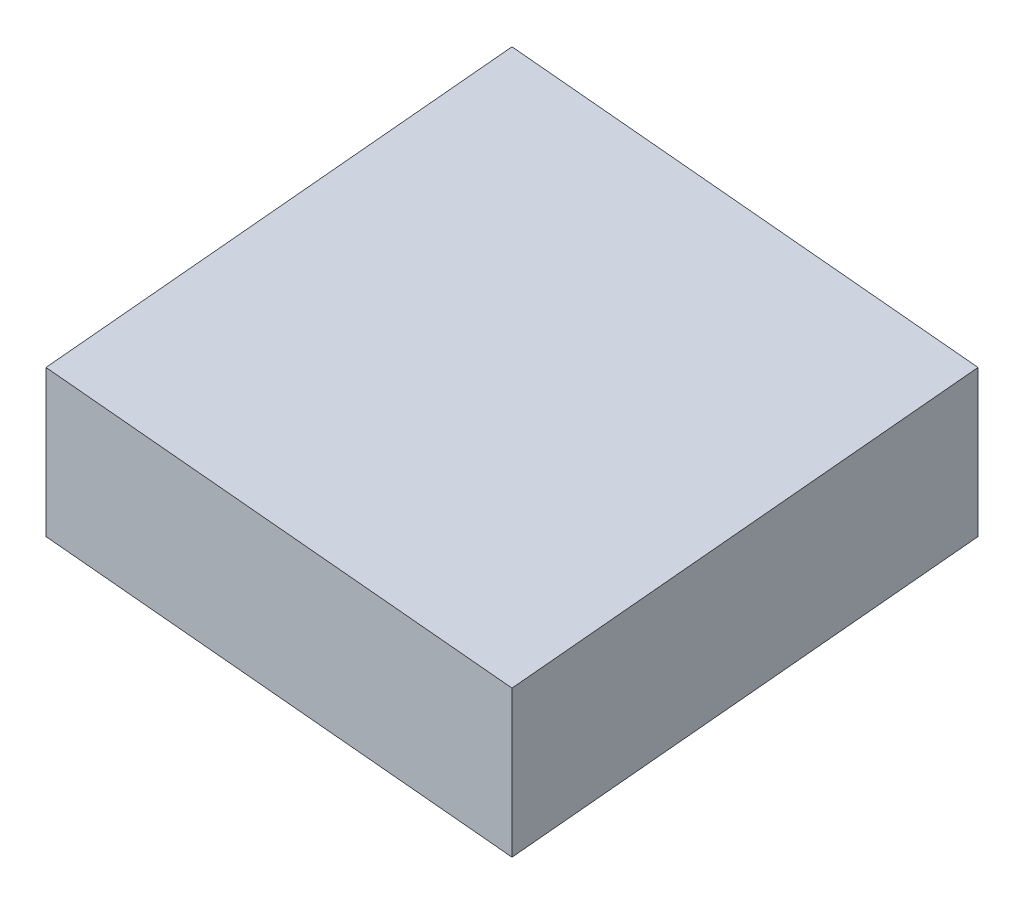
ISO-10303-21;
HEADER;
FILE_DESCRIPTION(('STEP AP214'),'2;1');
FILE_NAME('part.step','',(''),(''),'','','');
FILE_SCHEMA(('AUTOMOTIVE_DESIGN { 1 0 10303 214 1 1 1 1 }'));
ENDSEC;
DATA;
#1=APPLICATION_CONTEXT('core data for automotive mechanical design processes');
#2=APPLICATION_PROTOCOL_DEFINITION('international standard','automotive_design',2000,#1);
#3=PRODUCT_CONTEXT('',#1,'mechanical');
#4=PRODUCT('Part','Part','',(#3));
#5=PRODUCT_RELATED_PRODUCT_CATEGORY('part','',(#4));
#6=PRODUCT_DEFINITION_FORMATION('','',#4);
#7=PRODUCT_DEFINITION_CONTEXT('part definition',#1,'design');
#8=PRODUCT_DEFINITION('design','',#6,#7);
#9=PRODUCT_DEFINITION_SHAPE('','',#8);
#10=(LENGTH_UNIT() NAMED_UNIT(*) SI_UNIT(.MILLI.,.METRE.));
#11=(NAMED_UNIT(*) PLANE_ANGLE_UNIT() SI_UNIT($,.RADIAN.));
#12=(NAMED_UNIT(*) SI_UNIT($,.STERADIAN.) SOLID_ANGLE_UNIT());
#13=UNCERTAINTY_MEASURE_WITH_UNIT(LENGTH_MEASURE(1.E-05),#10,'distance_accuracy_value','');
#14=(GEOMETRIC_REPRESENTATION_CONTEXT(3) GLOBAL_UNCERTAINTY_ASSIGNED_CONTEXT((#13)) GLOBAL_UNIT_ASSIGNED_CONTEXT((#10,
#11,#12)) REPRESENTATION_CONTEXT('',''));
#15=CARTESIAN_POINT('',(0.,0.,0.));
#16=DIRECTION('',(0.,0.,1.));
#17=DIRECTION('',(1.,0.,0.));
#18=AXIS2_PLACEMENT_3D('',#15,#16,#17);
#19=CARTESIAN_POINT('',(0.,-0.0005,0.));
#20=DIRECTION('',(0.,1.,0.));
#21=DIRECTION('',(0.,0.,1.));
#22=AXIS2_PLACEMENT_3D('',#19,#20,#21);
#23=CYLINDRICAL_SURFACE('',#22,0.000500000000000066);
#24=CARTESIAN_POINT('',(0.,0.,0.));
#25=DIRECTION('',(0.,1.,0.));
#26=DIRECTION('',(0.,0.,1.));
#27=AXIS2_PLACEMENT_3D('',#24,#25,#26);
#28=CIRCLE('',#27,0.000500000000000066);
#29=CARTESIAN_POINT('',(0.,0.,0.000500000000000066));
#30=VERTEX_POINT('',#29);
#31=EDGE_CURVE('E11',#30,#30,#28,.F.);
#32=ORIENTED_EDGE('',*,*,#31,.F.);
#33=EDGE_LOOP('',(#32));
#34=FACE_BOUND('',#33,.T.);
#35=CARTESIAN_POINT('',(0.,0.0005,0.));
#36=DIRECTION('',(0.,1.,0.));
#37=DIRECTION('',(0.,0.,1.));
#38=AXIS2_PLACEMENT_3D('',#35,#36,#37);
#39=CIRCLE('',#38,0.000500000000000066);
#40=CARTESIAN_POINT('',(0.,0.0005,0.000500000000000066));
#41=VERTEX_POINT('',#40);
#42=EDGE_CURVE('E39',#41,#41,#39,.T.);
#43=ORIENTED_EDGE('',*,*,#42,.F.);
#44=EDGE_LOOP('',(#43));
#45=FACE_BOUND('',#44,.T.);
#46=ADVANCED_FACE('F31',(#34,#45),#23,.T.);
#47=CARTESIAN_POINT('',(0.,0.0005,0.));
#48=DIRECTION('',(0.,1.,0.));
#49=DIRECTION('',(0.,0.,1.));
#50=AXIS2_PLACEMENT_3D('',#47,#48,#49);
#51=PLANE('',#50);
#52=ORIENTED_EDGE('',*,*,#42,.T.);
#53=EDGE_LOOP('',(#52));
#54=FACE_BOUND('',#53,.T.);
#55=ADVANCED_FACE('F164',(#54),#51,.T.);
#56=CARTESIAN_POINT('',(0.,-2.57142857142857,0.));
#57=DIRECTION('',(0.,1.,0.));
#58=DIRECTION('',(0.,0.,1.));
#59=AXIS2_PLACEMENT_3D('',#56,#57,#58);
#60=CYLINDRICAL_SURFACE('',#59,0.00100000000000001);
#61=CARTESIAN_POINT('',(0.,0.,0.));
#62=DIRECTION('',(0.,1.,0.));
#63=DIRECTION('',(0.,0.,1.));
#64=AXIS2_PLACEMENT_3D('',#61,#62,#63);
#65=CIRCLE('',#64,0.00100000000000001);
#66=CARTESIAN_POINT('',(8.71557427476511E-05,0.,-0.000996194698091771));
#67=VERTEX_POINT('',#66);
#68=CARTESIAN_POINT('',(-0.000996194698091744,0.,8.71557427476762E-05));
#69=VERTEX_POINT('',#68);
#70=EDGE_CURVE('E130',#67,#69,#65,.T.);
#71=ORIENTED_EDGE('',*,*,#70,.F.);
#72=DIRECTION('',(0.,1.,0.));
#73=VECTOR('',#72,1.);
#74=CARTESIAN_POINT('',(8.71557427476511E-05,-2.57142857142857,-0.000996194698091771));
#75=LINE('',#74,#73);
#76=CARTESIAN_POINT('',(8.71557427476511E-05,-2.57142857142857,-0.000996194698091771));
#77=VERTEX_POINT('',#76);
#78=EDGE_CURVE('E47',#77,#67,#75,.T.);
#79=ORIENTED_EDGE('',*,*,#78,.F.);
#80=CARTESIAN_POINT('',(0.,-2.57142857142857,0.));
#81=DIRECTION('',(0.,1.,0.));
#82=DIRECTION('',(0.,0.,1.));
#83=AXIS2_PLACEMENT_3D('',#80,#81,#82);
#84=CIRCLE('',#83,0.00100000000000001);
#85=CARTESIAN_POINT('',(-0.000996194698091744,-2.57142857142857,8.71557427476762E-05));
#86=VERTEX_POINT('',#85);
#87=EDGE_CURVE('E151',#77,#86,#84,.T.);
#88=ORIENTED_EDGE('',*,*,#87,.T.);
#89=DIRECTION('',(0.,1.,0.));
#90=VECTOR('',#89,1.);
#91=CARTESIAN_POINT('',(-0.000996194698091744,-2.57142857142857,8.71557427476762E-05));
#92=LINE('',#91,#90);
#93=EDGE_CURVE('E88',#86,#69,#92,.T.);
#94=ORIENTED_EDGE('',*,*,#93,.T.);
#95=EDGE_LOOP('',(#71,#79,#88,#94));
#96=FACE_BOUND('',#95,.T.);
#97=ADVANCED_FACE('F171',(#96),#60,.T.);
#98=CARTESIAN_POINT('',(8.96484324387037,-2.57142857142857,0.783318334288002));
#99=DIRECTION('',(0.087155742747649,0.,-0.996194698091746));
#100=DIRECTION('',(-0.996194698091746,0.,-0.087155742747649));
#101=AXIS2_PLACEMENT_3D('',#98,#99,#100);
#102=PLANE('',#101);
#103=DIRECTION('',(-0.996194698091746,0.,-0.087155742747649));
#104=VECTOR('',#103,1.);
#105=CARTESIAN_POINT('',(8.96484324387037,0.,0.783318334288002));
#106=LINE('',#105,#104);
#107=CARTESIAN_POINT('',(8.96484324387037,0.,0.783318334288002));
#108=VERTEX_POINT('',#107);
#109=EDGE_CURVE('E148',#108,#67,#106,.T.);
#110=ORIENTED_EDGE('',*,*,#109,.F.);
#111=DIRECTION('',(0.,1.,0.));
#112=VECTOR('',#111,1.);
#113=CARTESIAN_POINT('',(8.96484324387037,-2.57142857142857,0.783318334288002));
#114=LINE('',#113,#112);
#115=CARTESIAN_POINT('',(8.96484324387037,-2.57142857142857,0.783318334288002));
#116=VERTEX_POINT('',#115);
#117=EDGE_CURVE('E76',#116,#108,#114,.T.);
#118=ORIENTED_EDGE('',*,*,#117,.F.);
#119=DIRECTION('',(-0.996194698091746,0.,-0.087155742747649));
#120=VECTOR('',#119,1.);
#121=CARTESIAN_POINT('',(8.96484324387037,-2.57142857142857,0.783318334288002));
#122=LINE('',#121,#120);
#123=EDGE_CURVE('E120',#116,#77,#122,.T.);
#124=ORIENTED_EDGE('',*,*,#123,.T.);
#125=ORIENTED_EDGE('',*,*,#78,.T.);
#126=EDGE_LOOP('',(#110,#118,#124,#125));
#127=FACE_BOUND('',#126,.T.);
#128=ADVANCED_FACE('F193',(#127),#102,.T.);
#129=CARTESIAN_POINT('',(8.96475608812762,-2.57142857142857,0.784314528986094));
#130=DIRECTION('',(0.,1.,0.));
#131=DIRECTION('',(0.,0.,1.));
#132=AXIS2_PLACEMENT_3D('',#129,#130,#131);
#133=CYLINDRICAL_SURFACE('',#132,0.000999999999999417);
#134=CARTESIAN_POINT('',(8.96475608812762,0.,0.784314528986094));
#135=DIRECTION('',(0.,1.,0.));
#136=DIRECTION('',(0.,0.,1.));
#137=AXIS2_PLACEMENT_3D('',#134,#135,#136);
#138=CIRCLE('',#137,0.000999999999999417);
#139=CARTESIAN_POINT('',(8.96575228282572,0.,0.784227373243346));
#140=VERTEX_POINT('',#139);
#141=EDGE_CURVE('E107',#140,#108,#138,.T.);
#142=ORIENTED_EDGE('',*,*,#141,.F.);
#143=DIRECTION('',(0.,1.,0.));
#144=VECTOR('',#143,1.);
#145=CARTESIAN_POINT('',(8.96575228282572,-2.57142857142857,0.784227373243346));
#146=LINE('',#145,#144);
#147=CARTESIAN_POINT('',(8.96575228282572,-2.57142857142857,0.784227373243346));
#148=VERTEX_POINT('',#147);
#149=EDGE_CURVE('E102',#148,#140,#146,.T.);
#150=ORIENTED_EDGE('',*,*,#149,.F.);
#151=CARTESIAN_POINT('',(8.96475608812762,-2.57142857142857,0.784314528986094));
#152=DIRECTION('',(0.,1.,0.));
#153=DIRECTION('',(0.,0.,1.));
#154=AXIS2_PLACEMENT_3D('',#151,#152,#153);
#155=CIRCLE('',#154,0.000999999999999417);
#156=EDGE_CURVE('E105',#148,#116,#155,.T.);
#157=ORIENTED_EDGE('',*,*,#156,.T.);
#158=ORIENTED_EDGE('',*,*,#117,.T.);
#159=EDGE_LOOP('',(#142,#150,#157,#158));
#160=FACE_BOUND('',#159,.T.);
#161=ADVANCED_FACE('F104',(#160),#133,.T.);
#162=CARTESIAN_POINT('',(9.75006681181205,-2.57142857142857,9.74898346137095));
#163=DIRECTION('',(0.996194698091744,0.,-0.0871557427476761));
#164=DIRECTION('',(-0.0871557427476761,0.,-0.996194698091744));
#165=AXIS2_PLACEMENT_3D('',#162,#163,#164);
#166=PLANE('',#165);
#167=DIRECTION('',(-0.0871557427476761,0.,-0.996194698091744));
#168=VECTOR('',#167,1.);
#169=CARTESIAN_POINT('',(9.75006681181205,0.,9.74898346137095));
#170=LINE('',#169,#168);
#171=CARTESIAN_POINT('',(9.75006681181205,0.,9.74898346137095));
#172=VERTEX_POINT('',#171);
#173=EDGE_CURVE('E145',#172,#140,#170,.T.);
#174=ORIENTED_EDGE('',*,*,#173,.F.);
#175=DIRECTION('',(0.,1.,0.));
#176=VECTOR('',#175,1.);
#177=CARTESIAN_POINT('',(9.75006681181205,-2.57142857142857,9.74898346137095));
#178=LINE('',#177,#176);
#179=CARTESIAN_POINT('',(9.75006681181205,-2.57142857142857,9.74898346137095));
#180=VERTEX_POINT('',#179);
#181=EDGE_CURVE('E112',#180,#172,#178,.T.);
#182=ORIENTED_EDGE('',*,*,#181,.F.);
#183=DIRECTION('',(-0.0871557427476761,0.,-0.996194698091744));
#184=VECTOR('',#183,1.);
#185=CARTESIAN_POINT('',(9.75006681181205,-2.57142857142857,9.74898346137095));
#186=LINE('',#185,#184);
#187=EDGE_CURVE('E118',#180,#148,#186,.T.);
#188=ORIENTED_EDGE('',*,*,#187,.T.);
#189=ORIENTED_EDGE('',*,*,#149,.T.);
#190=EDGE_LOOP('',(#174,#182,#188,#189));
#191=FACE_BOUND('',#190,.T.);
#192=ADVANCED_FACE('F122',(#191),#166,.T.);
#193=CARTESIAN_POINT('',(9.74907061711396,-2.57142857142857,9.74907061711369));
#194=DIRECTION('',(0.,1.,0.));
#195=DIRECTION('',(0.,0.,1.));
#196=AXIS2_PLACEMENT_3D('',#193,#194,#195);
#197=CYLINDRICAL_SURFACE('',#196,0.00100000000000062);
#198=CARTESIAN_POINT('',(9.74907061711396,0.,9.74907061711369));
#199=DIRECTION('',(0.,1.,0.));
#200=DIRECTION('',(0.,0.,1.));
#201=AXIS2_PLACEMENT_3D('',#198,#199,#200);
#202=CIRCLE('',#201,0.00100000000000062);
#203=CARTESIAN_POINT('',(9.74898346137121,0.,9.75006681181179));
#204=VERTEX_POINT('',#203);
#205=EDGE_CURVE('E142',#204,#172,#202,.T.);
#206=ORIENTED_EDGE('',*,*,#205,.F.);
#207=DIRECTION('',(0.,1.,0.));
#208=VECTOR('',#207,1.);
#209=CARTESIAN_POINT('',(9.74898346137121,-2.57142857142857,9.75006681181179));
#210=LINE('',#209,#208);
#211=CARTESIAN_POINT('',(9.74898346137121,-2.57142857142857,9.75006681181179));
#212=VERTEX_POINT('',#211);
#213=EDGE_CURVE('E155',#212,#204,#210,.T.);
#214=ORIENTED_EDGE('',*,*,#213,.F.);
#215=CARTESIAN_POINT('',(9.74907061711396,-2.57142857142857,9.74907061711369));
#216=DIRECTION('',(0.,1.,0.));
#217=DIRECTION('',(0.,0.,1.));
#218=AXIS2_PLACEMENT_3D('',#215,#216,#217);
#219=CIRCLE('',#218,0.00100000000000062);
#220=EDGE_CURVE('E123',#212,#180,#219,.T.);
#221=ORIENTED_EDGE('',*,*,#220,.T.);
#222=ORIENTED_EDGE('',*,*,#181,.T.);
#223=EDGE_LOOP('',(#206,#214,#221,#222));
#224=FACE_BOUND('',#223,.T.);
#225=ADVANCED_FACE('F192',(#224),#197,.T.);
#226=CARTESIAN_POINT('',(0.78422737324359,-2.57142857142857,8.96575228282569));
#227=DIRECTION('',(-0.0871557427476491,0.,0.996194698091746));
#228=DIRECTION('',(0.996194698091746,0.,0.0871557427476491));
#229=AXIS2_PLACEMENT_3D('',#226,#227,#228);
#230=PLANE('',#229);
#231=DIRECTION('',(0.996194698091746,0.,0.0871557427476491));
#232=VECTOR('',#231,1.);
#233=CARTESIAN_POINT('',(0.78422737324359,0.,8.96575228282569));
#234=LINE('',#233,#232);
#235=CARTESIAN_POINT('',(0.78422737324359,0.,8.96575228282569));
#236=VERTEX_POINT('',#235);
#237=EDGE_CURVE('E139',#236,#204,#234,.T.);
#238=ORIENTED_EDGE('',*,*,#237,.F.);
#239=DIRECTION('',(0.,1.,0.));
#240=VECTOR('',#239,1.);
#241=CARTESIAN_POINT('',(0.78422737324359,-2.57142857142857,8.96575228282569));
#242=LINE('',#241,#240);
#243=CARTESIAN_POINT('',(0.78422737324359,-2.57142857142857,8.96575228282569));
#244=VERTEX_POINT('',#243);
#245=EDGE_CURVE('E157',#244,#236,#242,.T.);
#246=ORIENTED_EDGE('',*,*,#245,.F.);
#247=DIRECTION('',(0.996194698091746,0.,0.0871557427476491));
#248=VECTOR('',#247,1.);
#249=CARTESIAN_POINT('',(0.78422737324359,-2.57142857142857,8.96575228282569));
#250=LINE('',#249,#248);
#251=EDGE_CURVE('E125',#244,#212,#250,.T.);
#252=ORIENTED_EDGE('',*,*,#251,.T.);
#253=ORIENTED_EDGE('',*,*,#213,.T.);
#254=EDGE_LOOP('',(#238,#246,#252,#253));
#255=FACE_BOUND('',#254,.T.);
#256=ADVANCED_FACE('F188',(#255),#230,.T.);
#257=CARTESIAN_POINT('',(0.784314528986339,-2.57142857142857,8.9647560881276));
#258=DIRECTION('',(0.,1.,0.));
#259=DIRECTION('',(0.,0.,1.));
#260=AXIS2_PLACEMENT_3D('',#257,#258,#259);
#261=CYLINDRICAL_SURFACE('',#260,0.000999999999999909);
#262=CARTESIAN_POINT('',(0.784314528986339,0.,8.9647560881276));
#263=DIRECTION('',(0.,1.,0.));
#264=DIRECTION('',(0.,0.,1.));
#265=AXIS2_PLACEMENT_3D('',#262,#263,#264);
#266=CIRCLE('',#265,0.000999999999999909);
#267=CARTESIAN_POINT('',(0.783318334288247,0.,8.96484324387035));
#268=VERTEX_POINT('',#267);
#269=EDGE_CURVE('E136',#268,#236,#266,.T.);
#270=ORIENTED_EDGE('',*,*,#269,.F.);
#271=DIRECTION('',(0.,1.,0.));
#272=VECTOR('',#271,1.);
#273=CARTESIAN_POINT('',(0.783318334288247,-2.57142857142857,8.96484324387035));
#274=LINE('',#273,#272);
#275=CARTESIAN_POINT('',(0.783318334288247,-2.57142857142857,8.96484324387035));
#276=VERTEX_POINT('',#275);
#277=EDGE_CURVE('E159',#276,#268,#274,.T.);
#278=ORIENTED_EDGE('',*,*,#277,.F.);
#279=CARTESIAN_POINT('',(0.784314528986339,-2.57142857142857,8.9647560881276));
#280=DIRECTION('',(0.,1.,0.));
#281=DIRECTION('',(0.,0.,1.));
#282=AXIS2_PLACEMENT_3D('',#279,#280,#281);
#283=CIRCLE('',#282,0.000999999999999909);
#284=EDGE_CURVE('E282',#276,#244,#283,.T.);
#285=ORIENTED_EDGE('',*,*,#284,.T.);
#286=ORIENTED_EDGE('',*,*,#245,.T.);
#287=EDGE_LOOP('',(#270,#278,#285,#286));
#288=FACE_BOUND('',#287,.T.);
#289=ADVANCED_FACE('F184',(#288),#261,.T.);
#290=CARTESIAN_POINT('',(-0.000996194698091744,-2.57142857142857,8.71557427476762E-05));
#291=DIRECTION('',(-0.996194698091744,0.,0.0871557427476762));
#292=DIRECTION('',(0.0871557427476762,0.,0.996194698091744));
#293=AXIS2_PLACEMENT_3D('',#290,#291,#292);
#294=PLANE('',#293);
#295=DIRECTION('',(0.0871557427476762,0.,0.996194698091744));
#296=VECTOR('',#295,1.);
#297=CARTESIAN_POINT('',(-0.000996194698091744,0.,8.71557427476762E-05));
#298=LINE('',#297,#296);
#299=EDGE_CURVE('E133',#69,#268,#298,.T.);
#300=ORIENTED_EDGE('',*,*,#299,.F.);
#301=ORIENTED_EDGE('',*,*,#93,.F.);
#302=DIRECTION('',(0.0871557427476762,0.,0.996194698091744));
#303=VECTOR('',#302,1.);
#304=CARTESIAN_POINT('',(-0.000996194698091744,-2.57142857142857,8.71557427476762E-05));
#305=LINE('',#304,#303);
#306=EDGE_CURVE('E180',#86,#276,#305,.T.);
#307=ORIENTED_EDGE('',*,*,#306,.T.);
#308=ORIENTED_EDGE('',*,*,#277,.T.);
#309=EDGE_LOOP('',(#300,#301,#307,#308));
#310=FACE_BOUND('',#309,.T.);
#311=ADVANCED_FACE('F178',(#310),#294,.T.);
#312=CARTESIAN_POINT('',(0.,-2.57142857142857,0.));
#313=DIRECTION('',(0.,1.,0.));
#314=DIRECTION('',(0.,0.,1.));
#315=AXIS2_PLACEMENT_3D('',#312,#313,#314);
#316=PLANE('',#315);
#317=ORIENTED_EDGE('',*,*,#87,.F.);
#318=ORIENTED_EDGE('',*,*,#123,.F.);
#319=ORIENTED_EDGE('',*,*,#156,.F.);
#320=ORIENTED_EDGE('',*,*,#187,.F.);
#321=ORIENTED_EDGE('',*,*,#220,.F.);
#322=ORIENTED_EDGE('',*,*,#251,.F.);
#323=ORIENTED_EDGE('',*,*,#284,.F.);
#324=ORIENTED_EDGE('',*,*,#306,.F.);
#325=EDGE_LOOP('',(#317,#318,#319,#320,#321,#322,#323,#324));
#326=FACE_BOUND('',#325,.T.);
#327=ADVANCED_FACE('F116',(#326),#316,.F.);
#328=CARTESIAN_POINT('',(0.,0.,0.));
#329=DIRECTION('',(0.,1.,0.));
#330=DIRECTION('',(0.,0.,1.));
#331=AXIS2_PLACEMENT_3D('',#328,#329,#330);
#332=PLANE('',#331);
#333=ORIENTED_EDGE('',*,*,#31,.T.);
#334=EDGE_LOOP('',(#333));
#335=FACE_BOUND('',#334,.T.);
#336=ORIENTED_EDGE('',*,*,#70,.T.);
#337=ORIENTED_EDGE('',*,*,#299,.T.);
#338=ORIENTED_EDGE('',*,*,#269,.T.);
#339=ORIENTED_EDGE('',*,*,#237,.T.);
#340=ORIENTED_EDGE('',*,*,#205,.T.);
#341=ORIENTED_EDGE('',*,*,#173,.T.);
#342=ORIENTED_EDGE('',*,*,#141,.T.);
#343=ORIENTED_EDGE('',*,*,#109,.T.);
#344=EDGE_LOOP('',(#336,#337,#338,#339,#340,#341,#342,#343));
#345=FACE_BOUND('',#344,.T.);
#346=ADVANCED_FACE('F174',(#335,#345),#332,.T.);
#347=CLOSED_SHELL('',(#46,#55,#97,#128,#161,#192,#225,#256,#289,#311,#327,#346));
#348=MANIFOLD_SOLID_BREP('B2',#347);
#349=ADVANCED_BREP_SHAPE_REPRESENTATION('',(#18,#348),#14);
#350=SHAPE_DEFINITION_REPRESENTATION(#9,#349);
ENDSEC;
END-ISO-10303-21;
